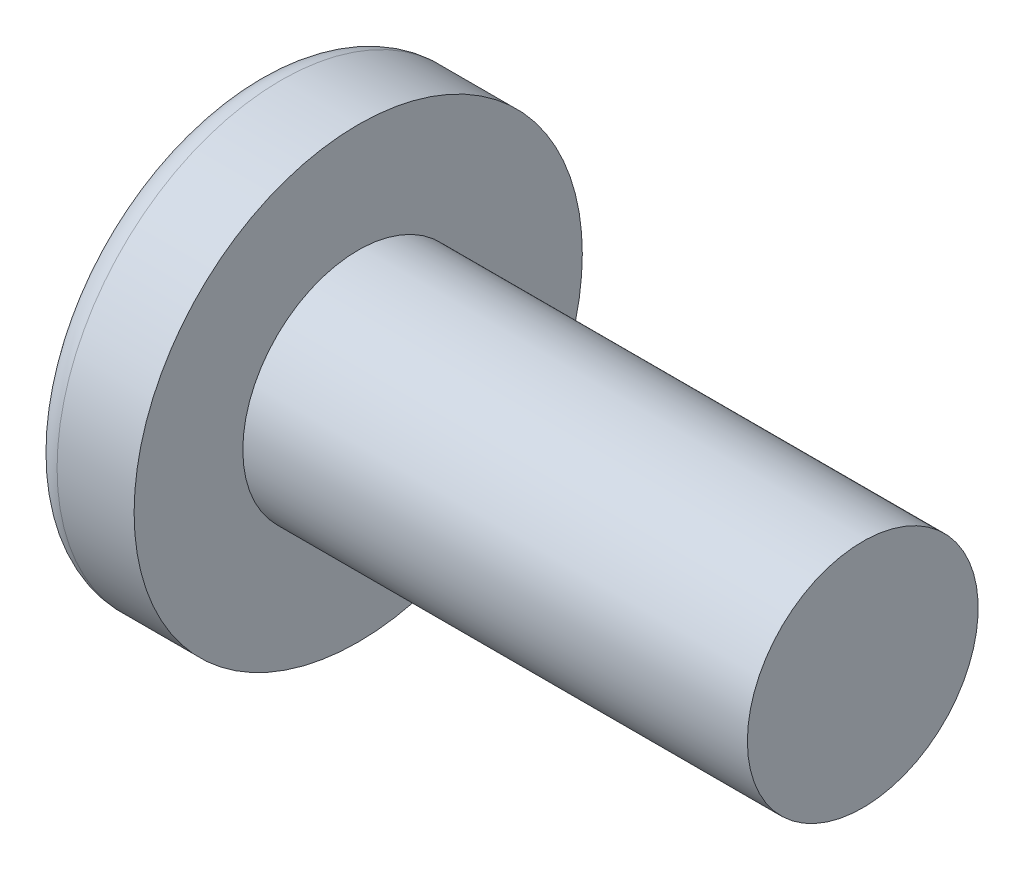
from build123d import *

# Parameters (mm, degrees)
CIRPATTERN1_COUNT = 2
CIRPATTERN1_ANGLE = 90


with BuildPart() as part:
    # BodySke → Base-Revolve (revolve)
    with BuildSketch(Plane.XY, mode=Mode.PRIVATE) as base_revolve_sk:
        with BuildLine():
            Line((1.5748, 1.0922), (1.5748, 2.1209))
            Line((1.5748, 2.1209), (0.845695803, 2.1209))
            ThreePointArc((0.845695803, 2.1209), (0.728748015, 2.09237553), (0.638066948, 2.013208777))
            ThreePointArc((0.638066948, 2.013208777), (0.163333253, 1.05595206), (0, 0))
            Line((0, 0), (6.35, 0))
            Line((6.35, 0), (6.35, 1.0922))
            Line((6.35, 1.0922), (1.5748, 1.0922))
        make_face()
    revolve(base_revolve_sk.sketch.rotate(Axis((-25.4, 0, 0), (1, 0, 0)), 90), axis=Axis((-25.4, 0, 0), (1, 0, 0)))

    # Sketch3 → Cut-Loft1 section 0
    with BuildSketch(Plane(origin=(0, 0, 0), x_dir=(0, 0, -1), z_dir=(1, 0, 0))):
        with BuildLine():
            Line((0.3429, -1.3843), (-0.3429, -1.3843))
            Line((-0.3429, -1.3843), (-0.3429, 1.3843))
            Line((-0.3429, 1.3843), (0.3429, 1.3843))
            Line((0.3429, 1.3843), (0.3429, -1.3843))
        make_face()
    # Sketch4 → Cut-Loft1 section 1
    with BuildSketch(Plane(origin=(1.4986, 0, 0), x_dir=(0, 0, -1), z_dir=(1, 0, 0))):
        with BuildLine():
            Line((0.17145, -0.17145), (-0.17145, -0.17145))
            Line((-0.17145, -0.17145), (-0.17145, 0.17145))
            Line((-0.17145, 0.17145), (0.17145, 0.17145))
            Line((0.17145, 0.17145), (0.17145, -0.17145))
        make_face()
    cut_loft1 = loft(mode=Mode.SUBTRACT)

    # CirPattern1: Cut-Loft1 ×2 about axis
    cirpattern1_axis = Axis((0, 0, 0), (1, 0, 0))
    for i in range(1, CIRPATTERN1_COUNT):
        add(cut_loft1.rotate(cirpattern1_axis, i * CIRPATTERN1_ANGLE / (CIRPATTERN1_COUNT - 1)), mode=Mode.SUBTRACT)


solid = part.part
